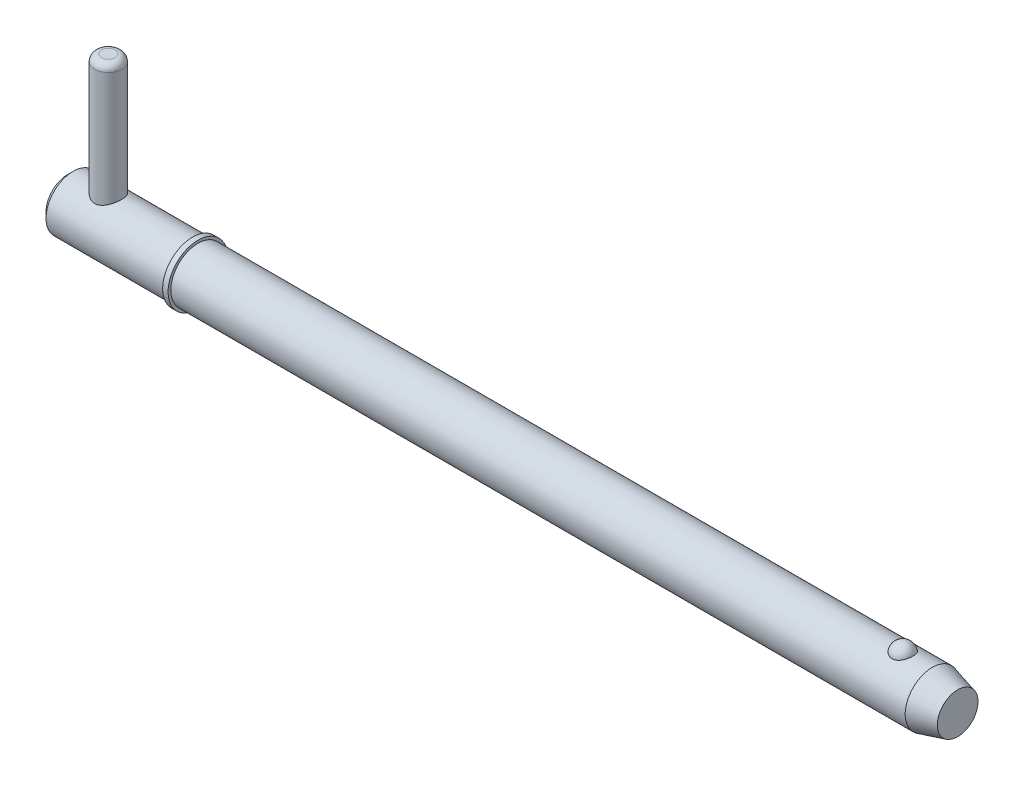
ISO-10303-21;
HEADER;
FILE_DESCRIPTION(('STEP AP214'),'2;1');
FILE_NAME('part.step','',(''),(''),'','','');
FILE_SCHEMA(('AUTOMOTIVE_DESIGN { 1 0 10303 214 1 1 1 1 }'));
ENDSEC;
DATA;
#1=APPLICATION_CONTEXT('core data for automotive mechanical design processes');
#2=APPLICATION_PROTOCOL_DEFINITION('international standard','automotive_design',2000,#1);
#3=PRODUCT_CONTEXT('',#1,'mechanical');
#4=PRODUCT('Part','Part','',(#3));
#5=PRODUCT_RELATED_PRODUCT_CATEGORY('part','',(#4));
#6=PRODUCT_DEFINITION_FORMATION('','',#4);
#7=PRODUCT_DEFINITION_CONTEXT('part definition',#1,'design');
#8=PRODUCT_DEFINITION('design','',#6,#7);
#9=PRODUCT_DEFINITION_SHAPE('','',#8);
#10=(LENGTH_UNIT() NAMED_UNIT(*) SI_UNIT(.MILLI.,.METRE.));
#11=(NAMED_UNIT(*) PLANE_ANGLE_UNIT() SI_UNIT($,.RADIAN.));
#12=(NAMED_UNIT(*) SI_UNIT($,.STERADIAN.) SOLID_ANGLE_UNIT());
#13=UNCERTAINTY_MEASURE_WITH_UNIT(LENGTH_MEASURE(1.E-05),#10,'distance_accuracy_value','');
#14=(GEOMETRIC_REPRESENTATION_CONTEXT(3) GLOBAL_UNCERTAINTY_ASSIGNED_CONTEXT((#13)) GLOBAL_UNIT_ASSIGNED_CONTEXT((#10,
#11,#12)) REPRESENTATION_CONTEXT('',''));
#15=CARTESIAN_POINT('',(0.,0.,0.));
#16=DIRECTION('',(0.,0.,1.));
#17=DIRECTION('',(1.,0.,0.));
#18=AXIS2_PLACEMENT_3D('',#15,#16,#17);
#19=CARTESIAN_POINT('',(5.94,21.43,0.));
#20=DIRECTION('',(0.,-1.,0.));
#21=DIRECTION('',(0.,0.,-1.));
#22=AXIS2_PLACEMENT_3D('',#19,#20,#21);
#23=CYLINDRICAL_SURFACE('',#22,1.98);
#24=CARTESIAN_POINT('',(5.94,-2.98,0.));
#25=DIRECTION('',(0.,1.,0.));
#26=DIRECTION('',(0.,0.,1.));
#27=AXIS2_PLACEMENT_3D('',#24,#25,#26);
#28=CIRCLE('',#27,1.98);
#29=CARTESIAN_POINT('',(5.94,-2.98,1.98));
#30=VERTEX_POINT('',#29);
#31=EDGE_CURVE('P0_E25',#30,#30,#28,.T.);
#32=ORIENTED_EDGE('',*,*,#31,.T.);
#33=EDGE_LOOP('',(#32));
#34=FACE_BOUND('',#33,.T.);
#35=CARTESIAN_POINT('',(5.94,20.44,0.));
#36=DIRECTION('',(0.,1.,0.));
#37=DIRECTION('',(0.,0.,1.));
#38=AXIS2_PLACEMENT_3D('',#35,#36,#37);
#39=CIRCLE('',#38,1.98);
#40=CARTESIAN_POINT('',(5.94,20.44,1.98));
#41=VERTEX_POINT('',#40);
#42=EDGE_CURVE('P0_E29',#41,#41,#39,.F.);
#43=ORIENTED_EDGE('',*,*,#42,.T.);
#44=EDGE_LOOP('',(#43));
#45=FACE_BOUND('',#44,.T.);
#46=ADVANCED_FACE('P0_F14',(#34,#45),#23,.T.);
#47=CARTESIAN_POINT('',(5.94,21.43,0.));
#48=DIRECTION('',(0.,1.,0.));
#49=DIRECTION('',(0.,0.,1.));
#50=AXIS2_PLACEMENT_3D('',#47,#48,#49);
#51=PLANE('',#50);
#52=CARTESIAN_POINT('',(5.94,21.43,0.));
#53=DIRECTION('',(0.,1.,0.));
#54=DIRECTION('',(0.,0.,1.));
#55=AXIS2_PLACEMENT_3D('',#52,#53,#54);
#56=CIRCLE('',#55,0.99);
#57=CARTESIAN_POINT('',(5.94,21.43,0.99));
#58=VERTEX_POINT('',#57);
#59=EDGE_CURVE('P0_E10',#58,#58,#56,.T.);
#60=ORIENTED_EDGE('',*,*,#59,.T.);
#61=EDGE_LOOP('',(#60));
#62=FACE_BOUND('',#61,.T.);
#63=ADVANCED_FACE('P0_F46',(#62),#51,.T.);
#64=CARTESIAN_POINT('',(5.94,-3.97,0.));
#65=DIRECTION('',(0.,1.,0.));
#66=DIRECTION('',(0.,0.,1.));
#67=AXIS2_PLACEMENT_3D('',#64,#65,#66);
#68=PLANE('',#67);
#69=CARTESIAN_POINT('',(5.94,-3.97,0.));
#70=DIRECTION('',(0.,1.,0.));
#71=DIRECTION('',(0.,0.,1.));
#72=AXIS2_PLACEMENT_3D('',#69,#70,#71);
#73=CIRCLE('',#72,0.99);
#74=CARTESIAN_POINT('',(5.94,-3.97,0.99));
#75=VERTEX_POINT('',#74);
#76=EDGE_CURVE('P0_E21',#75,#75,#73,.F.);
#77=ORIENTED_EDGE('',*,*,#76,.T.);
#78=EDGE_LOOP('',(#77));
#79=FACE_BOUND('',#78,.T.);
#80=ADVANCED_FACE('P0_F43',(#79),#68,.F.);
#81=CARTESIAN_POINT('',(5.94,-2.98,0.));
#82=DIRECTION('',(0.,1.,0.));
#83=DIRECTION('',(0.,0.,1.));
#84=AXIS2_PLACEMENT_3D('',#81,#82,#83);
#85=DEGENERATE_TOROIDAL_SURFACE('',#84,0.99,0.99,.T.);
#86=ORIENTED_EDGE('',*,*,#76,.F.);
#87=EDGE_LOOP('',(#86));
#88=FACE_BOUND('',#87,.T.);
#89=ORIENTED_EDGE('',*,*,#31,.F.);
#90=EDGE_LOOP('',(#89));
#91=FACE_BOUND('',#90,.T.);
#92=ADVANCED_FACE('P0_F38',(#88,#91),#85,.T.);
#93=CARTESIAN_POINT('',(5.94,20.44,0.));
#94=DIRECTION('',(0.,1.,0.));
#95=DIRECTION('',(0.,0.,1.));
#96=AXIS2_PLACEMENT_3D('',#93,#94,#95);
#97=DEGENERATE_TOROIDAL_SURFACE('',#96,0.99,0.99,.T.);
#98=ORIENTED_EDGE('',*,*,#42,.F.);
#99=EDGE_LOOP('',(#98));
#100=FACE_BOUND('',#99,.T.);
#101=ORIENTED_EDGE('',*,*,#59,.F.);
#102=EDGE_LOOP('',(#101));
#103=FACE_BOUND('',#102,.T.);
#104=ADVANCED_FACE('P0_F16',(#100,#103),#97,.T.);
#105=CLOSED_SHELL('',(#46,#63,#80,#92,#104));
#106=MANIFOLD_SOLID_BREP('P0_B1',#105);
#107=CARTESIAN_POINT('',(0.,0.,0.));
#108=DIRECTION('',(1.,0.,0.));
#109=DIRECTION('',(0.,0.,-1.));
#110=AXIS2_PLACEMENT_3D('',#107,#108,#109);
#111=CYLINDRICAL_SURFACE('',#110,3.97);
#112=CARTESIAN_POINT('',(126.475939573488,0.,0.));
#113=DIRECTION('',(1.,0.,0.));
#114=DIRECTION('',(0.,0.,-1.));
#115=AXIS2_PLACEMENT_3D('',#112,#113,#114);
#116=CIRCLE('',#115,3.97);
#117=CARTESIAN_POINT('',(126.475939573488,0.,-3.97));
#118=VERTEX_POINT('',#117);
#119=EDGE_CURVE('P1_E81',#118,#118,#116,.T.);
#120=ORIENTED_EDGE('',*,*,#119,.F.);
#121=EDGE_LOOP('',(#120));
#122=FACE_BOUND('',#121,.T.);
#123=CARTESIAN_POINT('',(19.05,0.,0.));
#124=DIRECTION('',(1.,0.,0.));
#125=DIRECTION('',(0.,0.,-1.));
#126=AXIS2_PLACEMENT_3D('',#123,#124,#125);
#127=CIRCLE('',#126,3.97);
#128=CARTESIAN_POINT('',(19.05,0.,-3.97));
#129=VERTEX_POINT('',#128);
#130=EDGE_CURVE('P1_E85',#129,#129,#127,.T.);
#131=ORIENTED_EDGE('',*,*,#130,.T.);
#132=EDGE_LOOP('',(#131));
#133=FACE_BOUND('',#132,.T.);
#134=CARTESIAN_POINT('',(122.145192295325,3.65715365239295,1.54470941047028));
#135=CARTESIAN_POINT('',(122.065244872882,3.65716001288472,1.54470290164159));
#136=CARTESIAN_POINT('',(121.985165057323,3.65987074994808,1.53832549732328));
#137=CARTESIAN_POINT('',(121.827237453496,3.6704221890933,1.51297018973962));
#138=CARTESIAN_POINT('',(121.74939614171,3.67827646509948,1.49395894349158));
#139=CARTESIAN_POINT('',(121.598461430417,3.69818848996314,1.44395950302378));
#140=CARTESIAN_POINT('',(121.525356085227,3.71023513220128,1.41300293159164));
#141=CARTESIAN_POINT('',(121.385563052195,3.73721833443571,1.34000212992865));
#142=CARTESIAN_POINT('',(121.318872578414,3.75215363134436,1.2979627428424));
#143=CARTESIAN_POINT('',(121.19148864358,3.78384968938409,1.20248834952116));
#144=CARTESIAN_POINT('',(121.131029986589,3.80065129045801,1.14875388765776));
#145=CARTESIAN_POINT('',(121.019694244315,3.83398532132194,1.03205417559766));
#146=CARTESIAN_POINT('',(120.968820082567,3.85051766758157,0.969086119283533));
#147=CARTESIAN_POINT('',(120.875632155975,3.88238608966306,0.832526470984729));
#148=CARTESIAN_POINT('',(120.833796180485,3.89763698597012,0.75858832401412));
#149=CARTESIAN_POINT('',(120.762510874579,3.92451063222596,0.60435211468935));
#150=CARTESIAN_POINT('',(120.733062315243,3.93613315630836,0.524053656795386));
#151=CARTESIAN_POINT('',(120.686892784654,3.95467606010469,0.358403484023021));
#152=CARTESIAN_POINT('',(120.670312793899,3.96154426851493,0.273006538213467));
#153=CARTESIAN_POINT('',(120.650756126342,3.96967008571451,0.100408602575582));
#154=CARTESIAN_POINT('',(120.647778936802,3.97092790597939,0.0132076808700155));
#155=CARTESIAN_POINT('',(120.655458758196,3.96771794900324,-0.159844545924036));
#156=CARTESIAN_POINT('',(120.666016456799,3.96329187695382,-0.245701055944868));
#157=CARTESIAN_POINT('',(120.70038009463,3.94923163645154,-0.41427746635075));
#158=CARTESIAN_POINT('',(120.724186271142,3.93959737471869,-0.496997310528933));
#159=CARTESIAN_POINT('',(120.78461142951,3.91607752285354,-0.657113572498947));
#160=CARTESIAN_POINT('',(120.821249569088,3.90218558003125,-0.734501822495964));
#161=CARTESIAN_POINT('',(120.906593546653,3.87158287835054,-0.881704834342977));
#162=CARTESIAN_POINT('',(120.955300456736,3.8548718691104,-0.951518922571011));
#163=CARTESIAN_POINT('',(121.064116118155,3.82028735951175,-1.08208159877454));
#164=CARTESIAN_POINT('',(121.124295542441,3.80240713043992,-1.14276958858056));
#165=CARTESIAN_POINT('',(121.254493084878,3.76758161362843,-1.2528243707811));
#166=CARTESIAN_POINT('',(121.324510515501,3.75063626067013,-1.30219195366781));
#167=CARTESIAN_POINT('',(121.47118160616,3.71998948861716,-1.38729709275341));
#168=CARTESIAN_POINT('',(121.547681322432,3.70623183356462,-1.42327904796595));
#169=CARTESIAN_POINT('',(121.706298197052,3.68323188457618,-1.48178996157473));
#170=CARTESIAN_POINT('',(121.7884132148,3.67398788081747,-1.5043240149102));
#171=CARTESIAN_POINT('',(121.951481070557,3.6615216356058,-1.53440939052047));
#172=CARTESIAN_POINT('',(122.032284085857,3.65801951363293,-1.54265826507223));
#173=CARTESIAN_POINT('',(122.19420850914,3.65657341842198,-1.54608423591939));
#174=CARTESIAN_POINT('',(122.275329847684,3.65862829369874,-1.54126404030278));
#175=CARTESIAN_POINT('',(122.432812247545,3.66788969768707,-1.51908474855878));
#176=CARTESIAN_POINT('',(122.509242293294,3.67492621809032,-1.50213925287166));
#177=CARTESIAN_POINT('',(122.658041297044,3.69318404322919,-1.45666982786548));
#178=CARTESIAN_POINT('',(122.730409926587,3.70440568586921,-1.42814496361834));
#179=CARTESIAN_POINT('',(122.870802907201,3.73012749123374,-1.35956319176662));
#180=CARTESIAN_POINT('',(122.938700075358,3.74469307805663,-1.31927107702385));
#181=CARTESIAN_POINT('',(123.066864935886,3.77545272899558,-1.22847440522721));
#182=CARTESIAN_POINT('',(123.127130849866,3.79164717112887,-1.17796747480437));
#183=CARTESIAN_POINT('',(123.241634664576,3.82490325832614,-1.06519260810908));
#184=CARTESIAN_POINT('',(123.295413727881,3.84196735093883,-1.00245914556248));
#185=CARTESIAN_POINT('',(123.392098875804,3.87439863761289,-0.868715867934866));
#186=CARTESIAN_POINT('',(123.435003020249,3.88976552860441,-0.797704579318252));
#187=CARTESIAN_POINT('',(123.510266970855,3.91771381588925,-0.646896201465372));
#188=CARTESIAN_POINT('',(123.54225322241,3.93019255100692,-0.566893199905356));
#189=CARTESIAN_POINT('',(123.593110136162,3.95043886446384,-0.402255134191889));
#190=CARTESIAN_POINT('',(123.611980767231,3.95820643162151,-0.317620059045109));
#191=CARTESIAN_POINT('',(123.63621625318,3.96823733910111,-0.146156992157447));
#192=CARTESIAN_POINT('',(123.641587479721,3.970503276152,-0.0593300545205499));
#193=CARTESIAN_POINT('',(123.638730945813,3.96930811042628,0.114057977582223));
#194=CARTESIAN_POINT('',(123.630503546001,3.9658471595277,0.200619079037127));
#195=CARTESIAN_POINT('',(123.600706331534,3.95358562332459,0.370506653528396));
#196=CARTESIAN_POINT('',(123.57921294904,3.94481563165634,0.453848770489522));
#197=CARTESIAN_POINT('',(123.52338397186,3.92284586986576,0.615497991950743));
#198=CARTESIAN_POINT('',(123.489047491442,3.90964579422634,0.693804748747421));
#199=CARTESIAN_POINT('',(123.407970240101,3.88006987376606,0.843703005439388));
#200=CARTESIAN_POINT('',(123.361153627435,3.86367478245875,0.915249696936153));
#201=CARTESIAN_POINT('',(123.256189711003,3.82949741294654,1.04910810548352));
#202=CARTESIAN_POINT('',(123.198042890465,3.81171519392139,1.11142021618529));
#203=CARTESIAN_POINT('',(123.071743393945,3.77673366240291,1.22503948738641));
#204=CARTESIAN_POINT('',(123.003597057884,3.75953398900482,1.27635357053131));
#205=CARTESIAN_POINT('',(122.858900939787,3.72770506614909,1.36653336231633));
#206=CARTESIAN_POINT('',(122.782348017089,3.71307678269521,1.40539439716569));
#207=CARTESIAN_POINT('',(122.625759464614,3.68864287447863,1.46830480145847));
#208=CARTESIAN_POINT('',(122.545930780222,3.67869017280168,1.49281289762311));
#209=CARTESIAN_POINT('',(122.382987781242,3.66414535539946,1.52817474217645));
#210=CARTESIAN_POINT('',(122.299884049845,3.65953723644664,1.53906926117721));
#211=CARTESIAN_POINT('',(122.192776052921,3.6573894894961,1.54414878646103));
#212=CARTESIAN_POINT('',(122.168990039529,3.65715175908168,1.54471134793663));
#213=CARTESIAN_POINT('',(122.145192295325,3.65715365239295,1.54470941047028));
#214=B_SPLINE_CURVE_WITH_KNOTS('',3,(#134,#135,#136,#137,#138,#139,#140,#141,#142,#143,#144,
#145,#146,#147,#148,#149,#150,#151,#152,#153,#154,#155,#156,#157,#158,#159,#160,#161,#162,#163,
#164,#165,#166,#167,#168,#169,#170,#171,#172,#173,#174,#175,#176,#177,#178,#179,#180,#181,#182,
#183,#184,#185,#186,#187,#188,#189,#190,#191,#192,#193,#194,#195,#196,#197,#198,#199,#200,#201,
#202,#203,#204,#205,#206,#207,#208,#209,#210,#211,#212,#213),.UNSPECIFIED.,.T.,.F.,(4,2,2,2,2,2,
2,2,2,2,2,2,2,2,2,2,2,2,2,2,2,2,2,2,2,2,2,2,2,2,2,2,2,2,2,2,2,2,2,4),(0.,0.239777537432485,
0.480190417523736,0.719971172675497,0.959647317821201,1.20639040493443,1.45320863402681,
1.7109367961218,1.96868099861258,2.22921052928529,2.48973023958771,2.74834928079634,
3.00697295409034,3.26598440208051,3.52501886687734,3.78570385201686,4.04637062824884,
4.30201257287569,4.5575576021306,4.80022994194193,5.04285200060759,5.27757006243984,
5.51230707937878,5.75210128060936,5.99195126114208,6.24392810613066,6.49594987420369,
6.75588818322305,7.01582710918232,7.27564332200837,7.53545264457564,7.79377886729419,
8.0521229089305,8.31207418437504,8.57201437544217,8.83179046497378,9.09166393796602,
9.34270057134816,9.59298357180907,9.66435753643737),.UNSPECIFIED.);
#215=CARTESIAN_POINT('',(122.145192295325,3.65715365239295,1.54470941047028));
#216=VERTEX_POINT('',#215);
#217=EDGE_CURVE('P1_E35',#216,#216,#214,.T.);
#218=ORIENTED_EDGE('',*,*,#217,.T.);
#219=EDGE_LOOP('',(#218));
#220=FACE_BOUND('',#219,.T.);
#221=ADVANCED_FACE('P1_F13',(#122,#133,#220),#111,.T.);
#222=CARTESIAN_POINT('',(0.,0.,0.));
#223=DIRECTION('',(-1.,0.,0.));
#224=DIRECTION('',(0.,0.,1.));
#225=AXIS2_PLACEMENT_3D('',#222,#223,#224);
#226=PLANE('',#225);
#227=CARTESIAN_POINT('',(0.,0.,0.));
#228=DIRECTION('',(1.,0.,0.));
#229=DIRECTION('',(0.,0.,-1.));
#230=AXIS2_PLACEMENT_3D('',#227,#228,#229);
#231=CIRCLE('',#230,3.176);
#232=CARTESIAN_POINT('',(0.,0.,-3.176));
#233=VERTEX_POINT('',#232);
#234=EDGE_CURVE('P1_E9',#233,#233,#231,.T.);
#235=ORIENTED_EDGE('',*,*,#234,.F.);
#236=EDGE_LOOP('',(#235));
#237=FACE_BOUND('',#236,.T.);
#238=ADVANCED_FACE('P1_F15',(#237),#226,.T.);
#239=CARTESIAN_POINT('',(0.793999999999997,0.,0.));
#240=DIRECTION('',(1.,0.,0.));
#241=DIRECTION('',(0.,0.,-1.));
#242=AXIS2_PLACEMENT_3D('',#239,#240,#241);
#243=CONICAL_SURFACE('',#242,3.97,0.78539816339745);
#244=ORIENTED_EDGE('',*,*,#234,.T.);
#245=EDGE_LOOP('',(#244));
#246=FACE_BOUND('',#245,.T.);
#247=CARTESIAN_POINT('',(0.793999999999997,0.,0.));
#248=DIRECTION('',(1.,0.,0.));
#249=DIRECTION('',(0.,0.,-1.));
#250=AXIS2_PLACEMENT_3D('',#247,#248,#249);
#251=CIRCLE('',#250,3.97);
#252=CARTESIAN_POINT('',(0.793999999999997,0.,-3.97));
#253=VERTEX_POINT('',#252);
#254=EDGE_CURVE('P1_E26',#253,#253,#251,.T.);
#255=ORIENTED_EDGE('',*,*,#254,.F.);
#256=EDGE_LOOP('',(#255));
#257=FACE_BOUND('',#256,.T.);
#258=ADVANCED_FACE('P1_F77',(#246,#257),#243,.T.);
#259=CARTESIAN_POINT('',(0.,0.,0.));
#260=DIRECTION('',(1.,0.,0.));
#261=DIRECTION('',(0.,0.,-1.));
#262=AXIS2_PLACEMENT_3D('',#259,#260,#261);
#263=CYLINDRICAL_SURFACE('',#262,3.97);
#264=CARTESIAN_POINT('',(5.94,-3.44100276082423,1.98));
#265=CARTESIAN_POINT('',(5.8367885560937,-3.44101282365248,1.97999171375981));
#266=CARTESIAN_POINT('',(5.73344176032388,-3.44571749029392,1.97187534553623));
#267=CARTESIAN_POINT('',(5.52991905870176,-3.46385873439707,1.93981946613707));
#268=CARTESIAN_POINT('',(5.42975031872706,-3.47731375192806,1.91584653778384));
#269=CARTESIAN_POINT('',(5.23590869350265,-3.51100678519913,1.85336773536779));
#270=CARTESIAN_POINT('',(5.14220446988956,-3.53120882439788,1.81493880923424));
#271=CARTESIAN_POINT('',(4.9625969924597,-3.57606420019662,1.72487335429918));
#272=CARTESIAN_POINT('',(4.87669412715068,-3.6007177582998,1.67323616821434));
#273=CARTESIAN_POINT('',(4.70734412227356,-3.65417020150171,1.55325205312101));
#274=CARTESIAN_POINT('',(4.62467662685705,-3.68314323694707,1.4838818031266));
#275=CARTESIAN_POINT('',(4.47154355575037,-3.74056406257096,1.33252902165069));
#276=CARTESIAN_POINT('',(4.40108404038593,-3.76901158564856,1.25054026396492));
#277=CARTESIAN_POINT('',(4.26974803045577,-3.82445556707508,1.06956584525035));
#278=CARTESIAN_POINT('',(4.20982960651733,-3.8512271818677,0.969809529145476));
#279=CARTESIAN_POINT('',(4.10798077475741,-3.89804342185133,0.760047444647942));
#280=CARTESIAN_POINT('',(4.06603907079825,-3.91809226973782,0.650048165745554));
#281=CARTESIAN_POINT('',(4.00441878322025,-3.94794912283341,0.431181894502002));
#282=CARTESIAN_POINT('',(3.98337329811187,-3.95838209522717,0.322786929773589));
#283=CARTESIAN_POINT('',(3.9596425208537,-3.97016407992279,0.103541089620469));
#284=CARTESIAN_POINT('',(3.95694618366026,-3.97151855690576,-0.00730826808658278));
#285=CARTESIAN_POINT('',(3.9694599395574,-3.96528826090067,-0.218044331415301));
#286=CARTESIAN_POINT('',(3.98314071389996,-3.95846689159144,-0.318049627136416));
#287=CARTESIAN_POINT('',(4.02528522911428,-3.93780347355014,-0.514124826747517));
#288=CARTESIAN_POINT('',(4.05375007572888,-3.92396089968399,-0.61019443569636));
#289=CARTESIAN_POINT('',(4.12484256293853,-3.89028355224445,-0.797351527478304));
#290=CARTESIAN_POINT('',(4.16766142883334,-3.87036821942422,-0.888351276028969));
#291=CARTESIAN_POINT('',(4.26598377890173,-3.82634285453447,-1.06209448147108));
#292=CARTESIAN_POINT('',(4.32149181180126,-3.8022313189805,-1.14483496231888));
#293=CARTESIAN_POINT('',(4.44962332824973,-3.74940011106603,-1.30802500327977));
#294=CARTESIAN_POINT('',(4.52336636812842,-3.72046031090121,-1.38752498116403));
#295=CARTESIAN_POINT('',(4.68287656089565,-3.66269463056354,-1.53354043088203));
#296=CARTESIAN_POINT('',(4.7686527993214,-3.63386885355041,-1.60004599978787));
#297=CARTESIAN_POINT('',(4.9564069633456,-3.57763161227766,-1.72228426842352));
#298=CARTESIAN_POINT('',(5.05906485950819,-3.5504233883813,-1.77707534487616));
#299=CARTESIAN_POINT('',(5.27381412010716,-3.50334038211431,-1.86819784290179));
#300=CARTESIAN_POINT('',(5.38589553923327,-3.48345798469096,-1.90454844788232));
#301=CARTESIAN_POINT('',(5.6069795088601,-3.45548331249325,-1.95481643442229));
#302=CARTESIAN_POINT('',(5.71552407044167,-3.44658268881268,-1.97028113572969));
#303=CARTESIAN_POINT('',(5.93399639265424,-3.43928114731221,-1.98300600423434));
#304=CARTESIAN_POINT('',(6.04392313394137,-3.44087289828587,-1.98027888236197));
#305=CARTESIAN_POINT('',(6.24931618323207,-3.45351901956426,-1.95811780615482));
#306=CARTESIAN_POINT('',(6.34505668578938,-3.46352725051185,-1.94052989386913));
#307=CARTESIAN_POINT('',(6.53204702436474,-3.49033612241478,-1.89188242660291));
#308=CARTESIAN_POINT('',(6.62329540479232,-3.50713894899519,-1.86081853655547));
#309=CARTESIAN_POINT('',(6.80352105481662,-3.54655680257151,-1.78458666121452));
#310=CARTESIAN_POINT('',(6.89219712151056,-3.56940508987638,-1.73883178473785));
#311=CARTESIAN_POINT('',(7.06112449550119,-3.61813012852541,-1.63502913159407));
#312=CARTESIAN_POINT('',(7.14137144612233,-3.6440084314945,-1.57697504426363));
#313=CARTESIAN_POINT('',(7.30168083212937,-3.69977514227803,-1.44171920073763));
#314=CARTESIAN_POINT('',(7.38046039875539,-3.7297597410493,-1.36302972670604));
#315=CARTESIAN_POINT('',(7.52409649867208,-3.78754991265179,-1.19307190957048));
#316=CARTESIAN_POINT('',(7.58894840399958,-3.81535475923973,-1.10179940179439));
#317=CARTESIAN_POINT('',(7.70430122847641,-3.86658972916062,-0.906019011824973));
#318=CARTESIAN_POINT('',(7.75438714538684,-3.88988795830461,-0.801229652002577));
#319=CARTESIAN_POINT('',(7.83572184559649,-3.92848199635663,-0.583216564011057));
#320=CARTESIAN_POINT('',(7.86698708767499,-3.94378479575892,-0.470000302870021));
#321=CARTESIAN_POINT('',(7.90711051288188,-3.96355307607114,-0.249525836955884));
#322=CARTESIAN_POINT('',(7.91775648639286,-3.96888171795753,-0.142669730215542));
#323=CARTESIAN_POINT('',(7.92160247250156,-3.97079858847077,0.0714191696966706));
#324=CARTESIAN_POINT('',(7.91480852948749,-3.96738984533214,0.178651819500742));
#325=CARTESIAN_POINT('',(7.88515479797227,-3.9527181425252,0.383072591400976));
#326=CARTESIAN_POINT('',(7.8633739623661,-3.94198303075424,0.480459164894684));
#327=CARTESIAN_POINT('',(7.80581513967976,-3.91422178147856,0.670038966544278));
#328=CARTESIAN_POINT('',(7.77003513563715,-3.89719473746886,0.762231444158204));
#329=CARTESIAN_POINT('',(7.68389191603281,-3.85747818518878,0.943248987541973));
#330=CARTESIAN_POINT('',(7.63296879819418,-3.83457704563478,1.03175978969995));
#331=CARTESIAN_POINT('',(7.51869140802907,-3.7855122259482,1.19934744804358));
#332=CARTESIAN_POINT('',(7.45533142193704,-3.75934704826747,1.2784199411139));
#333=CARTESIAN_POINT('',(7.31068939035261,-3.70329841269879,1.433144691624));
#334=CARTESIAN_POINT('',(7.22825362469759,-3.67330340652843,1.50768183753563));
#335=CARTESIAN_POINT('',(7.05162367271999,-3.61514025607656,1.64226879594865));
#336=CARTESIAN_POINT('',(6.95741928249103,-3.58697372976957,1.70230590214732));
#337=CARTESIAN_POINT('',(6.75590859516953,-3.53504049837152,1.80775364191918));
#338=CARTESIAN_POINT('',(6.64828786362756,-3.51143624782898,1.85265616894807));
#339=CARTESIAN_POINT('',(6.48137774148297,-3.48289659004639,1.90544537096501));
#340=CARTESIAN_POINT('',(6.42488151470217,-3.4745323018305,1.9206071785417));
#341=CARTESIAN_POINT('',(6.31046920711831,-3.4604244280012,1.94591259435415));
#342=CARTESIAN_POINT('',(6.25255415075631,-3.45467900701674,1.95605971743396));
#343=CARTESIAN_POINT('',(6.1521444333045,-3.44728060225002,1.96905939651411));
#344=CARTESIAN_POINT('',(6.10985721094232,-3.44493297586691,1.97315742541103));
#345=CARTESIAN_POINT('',(6.02505433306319,-3.44179192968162,1.97862952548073));
#346=CARTESIAN_POINT('',(5.98253866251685,-3.44099861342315,1.98000341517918));
#347=CARTESIAN_POINT('',(5.94,-3.44100276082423,1.98));
#348=B_SPLINE_CURVE_WITH_KNOTS('',3,(#264,#265,#266,#267,#268,#269,#270,#271,#272,#273,#274,
#275,#276,#277,#278,#279,#280,#281,#282,#283,#284,#285,#286,#287,#288,#289,#290,#291,#292,#293,
#294,#295,#296,#297,#298,#299,#300,#301,#302,#303,#304,#305,#306,#307,#308,#309,#310,#311,#312,
#313,#314,#315,#316,#317,#318,#319,#320,#321,#322,#323,#324,#325,#326,#327,#328,#329,#330,#331,
#332,#333,#334,#335,#336,#337,#338,#339,#340,#341,#342,#343,#344,#345,#346,#347),.UNSPECIFIED.,
.T.,.F.,(4,2,2,2,2,2,2,2,2,2,2,2,2,2,2,2,2,2,2,2,2,2,2,2,2,2,2,2,2,2,2,2,2,2,2,2,2,2,2,2,2,4),
(0.,0.309462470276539,0.619579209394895,0.928068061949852,1.23657226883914,1.57038619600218,
1.90436536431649,2.26071614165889,2.61684266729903,2.94773555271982,3.27842924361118,
3.58050679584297,3.88260694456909,4.18890317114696,4.49530936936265,4.83057163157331,
5.1660884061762,5.52272472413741,5.87898927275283,6.20706708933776,6.53491569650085,
6.82716910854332,7.11951660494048,7.42541184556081,7.73146442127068,8.07586334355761,
8.42037652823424,8.77380887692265,9.12693169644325,9.44775848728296,9.76847409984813,
10.0682302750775,10.3680296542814,10.6806938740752,10.9935020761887,11.3373031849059,
11.6814044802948,12.0361164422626,12.2131519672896,12.3900632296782,12.5175998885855,
12.6451450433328),.UNSPECIFIED.);
#349=CARTESIAN_POINT('',(5.94,-3.44100276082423,1.98));
#350=VERTEX_POINT('',#349);
#351=EDGE_CURVE('P1_E17',#350,#350,#348,.T.);
#352=ORIENTED_EDGE('',*,*,#351,.F.);
#353=EDGE_LOOP('',(#352));
#354=FACE_BOUND('',#353,.T.);
#355=CARTESIAN_POINT('',(5.94,3.44100276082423,1.98));
#356=CARTESIAN_POINT('',(6.0432114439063,3.44101282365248,1.97999171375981));
#357=CARTESIAN_POINT('',(6.14655823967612,3.44571749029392,1.97187534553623));
#358=CARTESIAN_POINT('',(6.35008094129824,3.46385873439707,1.93981946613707));
#359=CARTESIAN_POINT('',(6.45024968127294,3.47731375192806,1.91584653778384));
#360=CARTESIAN_POINT('',(6.64409130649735,3.51100678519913,1.85336773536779));
#361=CARTESIAN_POINT('',(6.73779553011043,3.53120882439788,1.81493880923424));
#362=CARTESIAN_POINT('',(6.91740300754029,3.57606420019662,1.72487335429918));
#363=CARTESIAN_POINT('',(7.00330587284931,3.6007177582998,1.67323616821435));
#364=CARTESIAN_POINT('',(7.17265587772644,3.65417020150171,1.55325205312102));
#365=CARTESIAN_POINT('',(7.25532337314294,3.68314323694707,1.4838818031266));
#366=CARTESIAN_POINT('',(7.40845644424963,3.74056406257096,1.3325290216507));
#367=CARTESIAN_POINT('',(7.47891595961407,3.76901158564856,1.25054026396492));
#368=CARTESIAN_POINT('',(7.61025196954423,3.82445556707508,1.06956584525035));
#369=CARTESIAN_POINT('',(7.67017039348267,3.8512271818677,0.969809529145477));
#370=CARTESIAN_POINT('',(7.77201922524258,3.89804342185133,0.760047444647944));
#371=CARTESIAN_POINT('',(7.81396092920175,3.91809226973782,0.650048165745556));
#372=CARTESIAN_POINT('',(7.87558121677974,3.94794912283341,0.431181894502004));
#373=CARTESIAN_POINT('',(7.89662670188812,3.95838209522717,0.322786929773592));
#374=CARTESIAN_POINT('',(7.9203574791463,3.97016407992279,0.103541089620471));
#375=CARTESIAN_POINT('',(7.92305381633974,3.97151855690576,-0.00730826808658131));
#376=CARTESIAN_POINT('',(7.9105400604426,3.96528826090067,-0.2180443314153));
#377=CARTESIAN_POINT('',(7.89685928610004,3.95846689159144,-0.318049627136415));
#378=CARTESIAN_POINT('',(7.85471477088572,3.93780347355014,-0.514124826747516));
#379=CARTESIAN_POINT('',(7.82624992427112,3.92396089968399,-0.61019443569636));
#380=CARTESIAN_POINT('',(7.75515743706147,3.89028355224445,-0.797351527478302));
#381=CARTESIAN_POINT('',(7.71233857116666,3.87036821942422,-0.888351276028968));
#382=CARTESIAN_POINT('',(7.61401622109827,3.82634285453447,-1.06209448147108));
#383=CARTESIAN_POINT('',(7.55850818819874,3.8022313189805,-1.14483496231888));
#384=CARTESIAN_POINT('',(7.43037667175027,3.74940011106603,-1.30802500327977));
#385=CARTESIAN_POINT('',(7.35663363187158,3.72046031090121,-1.38752498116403));
#386=CARTESIAN_POINT('',(7.19712343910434,3.66269463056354,-1.53354043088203));
#387=CARTESIAN_POINT('',(7.1113472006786,3.63386885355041,-1.60004599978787));
#388=CARTESIAN_POINT('',(6.9235930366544,3.57763161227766,-1.72228426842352));
#389=CARTESIAN_POINT('',(6.82093514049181,3.5504233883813,-1.77707534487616));
#390=CARTESIAN_POINT('',(6.60618587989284,3.50334038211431,-1.86819784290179));
#391=CARTESIAN_POINT('',(6.49410446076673,3.48345798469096,-1.90454844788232));
#392=CARTESIAN_POINT('',(6.2730204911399,3.45548331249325,-1.95481643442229));
#393=CARTESIAN_POINT('',(6.16447592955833,3.44658268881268,-1.97028113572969));
#394=CARTESIAN_POINT('',(5.94600360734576,3.43928114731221,-1.98300600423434));
#395=CARTESIAN_POINT('',(5.83607686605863,3.44087289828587,-1.98027888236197));
#396=CARTESIAN_POINT('',(5.63068381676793,3.45351901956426,-1.95811780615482));
#397=CARTESIAN_POINT('',(5.53494331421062,3.46352725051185,-1.94052989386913));
#398=CARTESIAN_POINT('',(5.34795297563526,3.49033612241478,-1.89188242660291));
#399=CARTESIAN_POINT('',(5.25670459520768,3.50713894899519,-1.86081853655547));
#400=CARTESIAN_POINT('',(5.07647894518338,3.54655680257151,-1.78458666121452));
#401=CARTESIAN_POINT('',(4.98780287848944,3.56940508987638,-1.73883178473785));
#402=CARTESIAN_POINT('',(4.81887550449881,3.61813012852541,-1.63502913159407));
#403=CARTESIAN_POINT('',(4.73862855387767,3.6440084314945,-1.57697504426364));
#404=CARTESIAN_POINT('',(4.57831916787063,3.69977514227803,-1.44171920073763));
#405=CARTESIAN_POINT('',(4.49953960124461,3.7297597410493,-1.36302972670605));
#406=CARTESIAN_POINT('',(4.35590350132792,3.78754991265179,-1.19307190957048));
#407=CARTESIAN_POINT('',(4.29105159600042,3.81535475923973,-1.10179940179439));
#408=CARTESIAN_POINT('',(4.17569877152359,3.86658972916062,-0.906019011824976));
#409=CARTESIAN_POINT('',(4.12561285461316,3.88988795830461,-0.80122965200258));
#410=CARTESIAN_POINT('',(4.04427815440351,3.92848199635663,-0.58321656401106));
#411=CARTESIAN_POINT('',(4.01301291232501,3.94378479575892,-0.470000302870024));
#412=CARTESIAN_POINT('',(3.97288948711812,3.96355307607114,-0.249525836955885));
#413=CARTESIAN_POINT('',(3.96224351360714,3.96888171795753,-0.142669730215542));
#414=CARTESIAN_POINT('',(3.95839752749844,3.97079858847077,0.0714191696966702));
#415=CARTESIAN_POINT('',(3.96519147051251,3.96738984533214,0.178651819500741));
#416=CARTESIAN_POINT('',(3.99484520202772,3.9527181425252,0.383072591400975));
#417=CARTESIAN_POINT('',(4.01662603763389,3.94198303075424,0.480459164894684));
#418=CARTESIAN_POINT('',(4.07418486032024,3.91422178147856,0.670038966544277));
#419=CARTESIAN_POINT('',(4.10996486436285,3.89719473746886,0.762231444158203));
#420=CARTESIAN_POINT('',(4.19610808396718,3.85747818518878,0.943248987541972));
#421=CARTESIAN_POINT('',(4.24703120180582,3.83457704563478,1.03175978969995));
#422=CARTESIAN_POINT('',(4.36130859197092,3.7855122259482,1.19934744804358));
#423=CARTESIAN_POINT('',(4.42466857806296,3.75934704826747,1.2784199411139));
#424=CARTESIAN_POINT('',(4.56931060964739,3.70329841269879,1.433144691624));
#425=CARTESIAN_POINT('',(4.65174637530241,3.67330340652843,1.50768183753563));
#426=CARTESIAN_POINT('',(4.82837632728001,3.61514025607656,1.64226879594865));
#427=CARTESIAN_POINT('',(4.92258071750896,3.58697372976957,1.70230590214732));
#428=CARTESIAN_POINT('',(5.12409140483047,3.53504049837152,1.80775364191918));
#429=CARTESIAN_POINT('',(5.23171213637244,3.51143624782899,1.85265616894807));
#430=CARTESIAN_POINT('',(5.39862225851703,3.48289659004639,1.90544537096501));
#431=CARTESIAN_POINT('',(5.45511848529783,3.4745323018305,1.9206071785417));
#432=CARTESIAN_POINT('',(5.56953079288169,3.4604244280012,1.94591259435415));
#433=CARTESIAN_POINT('',(5.62744584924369,3.45467900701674,1.95605971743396));
#434=CARTESIAN_POINT('',(5.7278555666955,3.44728060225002,1.9690593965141));
#435=CARTESIAN_POINT('',(5.77014278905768,3.44493297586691,1.97315742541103));
#436=CARTESIAN_POINT('',(5.85494566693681,3.44179192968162,1.97862952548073));
#437=CARTESIAN_POINT('',(5.89746133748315,3.44099861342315,1.98000341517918));
#438=CARTESIAN_POINT('',(5.94,3.44100276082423,1.98));
#439=B_SPLINE_CURVE_WITH_KNOTS('',3,(#355,#356,#357,#358,#359,#360,#361,#362,#363,#364,#365,
#366,#367,#368,#369,#370,#371,#372,#373,#374,#375,#376,#377,#378,#379,#380,#381,#382,#383,#384,
#385,#386,#387,#388,#389,#390,#391,#392,#393,#394,#395,#396,#397,#398,#399,#400,#401,#402,#403,
#404,#405,#406,#407,#408,#409,#410,#411,#412,#413,#414,#415,#416,#417,#418,#419,#420,#421,#422,
#423,#424,#425,#426,#427,#428,#429,#430,#431,#432,#433,#434,#435,#436,#437,#438),.UNSPECIFIED.,
.T.,.F.,(4,2,2,2,2,2,2,2,2,2,2,2,2,2,2,2,2,2,2,2,2,2,2,2,2,2,2,2,2,2,2,2,2,2,2,2,2,2,2,2,2,4),
(0.,0.309462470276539,0.619579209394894,0.928068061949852,1.23657226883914,1.57038619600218,
1.90436536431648,2.26071614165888,2.61684266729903,2.94773555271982,3.27842924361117,
3.58050679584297,3.88260694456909,4.18890317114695,4.49530936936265,4.83057163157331,
5.1660884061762,5.5227247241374,5.87898927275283,6.20706708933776,6.53491569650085,
6.82716910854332,7.11951660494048,7.42541184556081,7.73146442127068,8.07586334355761,
8.42037652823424,8.77380887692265,9.12693169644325,9.44775848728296,9.76847409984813,
10.0682302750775,10.3680296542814,10.6806938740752,10.9935020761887,11.3373031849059,
11.6814044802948,12.0361164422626,12.2131519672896,12.3900632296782,12.5175998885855,
12.6451450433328),.UNSPECIFIED.);
#440=CARTESIAN_POINT('',(5.94,3.44100276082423,1.98));
#441=VERTEX_POINT('',#440);
#442=EDGE_CURVE('P1_E43',#441,#441,#439,.T.);
#443=ORIENTED_EDGE('',*,*,#442,.F.);
#444=EDGE_LOOP('',(#443));
#445=FACE_BOUND('',#444,.T.);
#446=ORIENTED_EDGE('',*,*,#254,.T.);
#447=EDGE_LOOP('',(#446));
#448=FACE_BOUND('',#447,.T.);
#449=CARTESIAN_POINT('',(18.256,0.,0.));
#450=DIRECTION('',(1.,0.,0.));
#451=DIRECTION('',(0.,0.,-1.));
#452=AXIS2_PLACEMENT_3D('',#449,#450,#451);
#453=CIRCLE('',#452,3.97);
#454=CARTESIAN_POINT('',(18.256,0.,-3.97));
#455=VERTEX_POINT('',#454);
#456=EDGE_CURVE('P1_E31',#455,#455,#453,.T.);
#457=ORIENTED_EDGE('',*,*,#456,.F.);
#458=EDGE_LOOP('',(#457));
#459=FACE_BOUND('',#458,.T.);
#460=ADVANCED_FACE('P1_F103',(#354,#445,#448,#459),#263,.T.);
#461=CARTESIAN_POINT('',(18.256,3.97,0.));
#462=DIRECTION('',(-1.,0.,0.));
#463=DIRECTION('',(0.,0.,1.));
#464=AXIS2_PLACEMENT_3D('',#461,#462,#463);
#465=PLANE('',#464);
#466=ORIENTED_EDGE('',*,*,#456,.T.);
#467=EDGE_LOOP('',(#466));
#468=FACE_BOUND('',#467,.T.);
#469=CARTESIAN_POINT('',(18.256,0.,0.));
#470=DIRECTION('',(1.,0.,0.));
#471=DIRECTION('',(0.,0.,-1.));
#472=AXIS2_PLACEMENT_3D('',#469,#470,#471);
#473=CIRCLE('',#472,4.367);
#474=CARTESIAN_POINT('',(18.256,0.,-4.367));
#475=VERTEX_POINT('',#474);
#476=EDGE_CURVE('P1_E91',#475,#475,#473,.T.);
#477=ORIENTED_EDGE('',*,*,#476,.F.);
#478=EDGE_LOOP('',(#477));
#479=FACE_BOUND('',#478,.T.);
#480=ADVANCED_FACE('P1_F100',(#468,#479),#465,.T.);
#481=CARTESIAN_POINT('',(0.,0.,0.));
#482=DIRECTION('',(1.,0.,0.));
#483=DIRECTION('',(0.,0.,-1.));
#484=AXIS2_PLACEMENT_3D('',#481,#482,#483);
#485=CYLINDRICAL_SURFACE('',#484,4.367);
#486=ORIENTED_EDGE('',*,*,#476,.T.);
#487=EDGE_LOOP('',(#486));
#488=FACE_BOUND('',#487,.T.);
#489=CARTESIAN_POINT('',(19.05,0.,0.));
#490=DIRECTION('',(1.,0.,0.));
#491=DIRECTION('',(0.,0.,-1.));
#492=AXIS2_PLACEMENT_3D('',#489,#490,#491);
#493=CIRCLE('',#492,4.367);
#494=CARTESIAN_POINT('',(19.05,0.,-4.367));
#495=VERTEX_POINT('',#494);
#496=EDGE_CURVE('P1_E88',#495,#495,#493,.T.);
#497=ORIENTED_EDGE('',*,*,#496,.F.);
#498=EDGE_LOOP('',(#497));
#499=FACE_BOUND('',#498,.T.);
#500=ADVANCED_FACE('P1_F68',(#488,#499),#485,.T.);
#501=CARTESIAN_POINT('',(19.05,4.367,0.));
#502=DIRECTION('',(1.,0.,0.));
#503=DIRECTION('',(0.,0.,-1.));
#504=AXIS2_PLACEMENT_3D('',#501,#502,#503);
#505=PLANE('',#504);
#506=ORIENTED_EDGE('',*,*,#496,.T.);
#507=EDGE_LOOP('',(#506));
#508=FACE_BOUND('',#507,.T.);
#509=ORIENTED_EDGE('',*,*,#130,.F.);
#510=EDGE_LOOP('',(#509));
#511=FACE_BOUND('',#510,.T.);
#512=ADVANCED_FACE('P1_F62',(#508,#511),#505,.T.);
#513=CARTESIAN_POINT('',(130.18,0.,0.));
#514=DIRECTION('',(-1.,0.,0.));
#515=DIRECTION('',(0.,0.,1.));
#516=AXIS2_PLACEMENT_3D('',#513,#514,#515);
#517=CONICAL_SURFACE('',#516,2.97750000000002,0.261799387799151);
#518=ORIENTED_EDGE('',*,*,#119,.T.);
#519=EDGE_LOOP('',(#518));
#520=FACE_BOUND('',#519,.T.);
#521=CARTESIAN_POINT('',(130.18,0.,0.));
#522=DIRECTION('',(1.,0.,0.));
#523=DIRECTION('',(0.,0.,-1.));
#524=AXIS2_PLACEMENT_3D('',#521,#522,#523);
#525=CIRCLE('',#524,2.97750000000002);
#526=CARTESIAN_POINT('',(130.18,0.,-2.97750000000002));
#527=VERTEX_POINT('',#526);
#528=EDGE_CURVE('P1_E42',#527,#527,#525,.T.);
#529=ORIENTED_EDGE('',*,*,#528,.F.);
#530=EDGE_LOOP('',(#529));
#531=FACE_BOUND('',#530,.T.);
#532=ADVANCED_FACE('P1_F59',(#520,#531),#517,.T.);
#533=CARTESIAN_POINT('',(130.18,2.97750000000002,0.));
#534=DIRECTION('',(1.,0.,0.));
#535=DIRECTION('',(0.,0.,-1.));
#536=AXIS2_PLACEMENT_3D('',#533,#534,#535);
#537=PLANE('',#536);
#538=ORIENTED_EDGE('',*,*,#528,.T.);
#539=EDGE_LOOP('',(#538));
#540=FACE_BOUND('',#539,.T.);
#541=ADVANCED_FACE('P1_F55',(#540),#537,.T.);
#542=CARTESIAN_POINT('',(122.145192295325,3.573,0.));
#543=DIRECTION('',(-1.,0.,0.));
#544=DIRECTION('',(0.,-1.,0.));
#545=AXIS2_PLACEMENT_3D('',#542,#543,#544);
#546=SPHERICAL_SURFACE('',#545,1.54699999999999);
#547=ORIENTED_EDGE('',*,*,#217,.F.);
#548=EDGE_LOOP('',(#547));
#549=FACE_BOUND('',#548,.T.);
#550=ADVANCED_FACE('P1_F50',(#549),#546,.T.);
#551=CARTESIAN_POINT('',(5.94,-4.367,0.));
#552=DIRECTION('',(0.,1.,0.));
#553=DIRECTION('',(0.,0.,1.));
#554=AXIS2_PLACEMENT_3D('',#551,#552,#553);
#555=CYLINDRICAL_SURFACE('',#554,1.98);
#556=ORIENTED_EDGE('',*,*,#351,.T.);
#557=EDGE_LOOP('',(#556));
#558=FACE_BOUND('',#557,.T.);
#559=ORIENTED_EDGE('',*,*,#442,.T.);
#560=EDGE_LOOP('',(#559));
#561=FACE_BOUND('',#560,.T.);
#562=ADVANCED_FACE('P1_F54',(#558,#561),#555,.F.);
#563=CLOSED_SHELL('',(#221,#238,#258,#460,#480,#500,#512,#532,#541,#550,#562));
#564=MANIFOLD_SOLID_BREP('P1_B1',#563);
#565=ADVANCED_BREP_SHAPE_REPRESENTATION('',(#18,#106,#564),#14);
#566=SHAPE_DEFINITION_REPRESENTATION(#9,#565);
ENDSEC;
END-ISO-10303-21;
